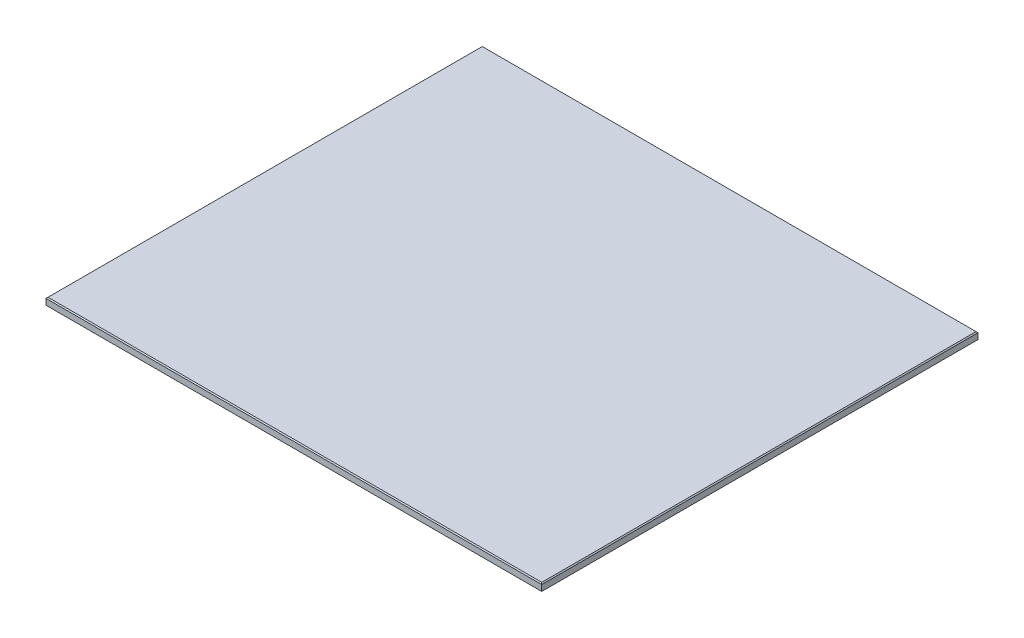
from build123d import *

# Parameters (mm, degrees)
SKETCH_1_W      = 250
SKETCH_1_H      = 220
EXTRUDE_1_DEPTH = 4
CHAMFER_1_SIZE  = 0.5


with BuildPart() as part:
    # Sketch 1 → Extrude 1 (new body)
    with BuildSketch(Plane(origin=(0, 0, 0), x_dir=(1, 0, 0), z_dir=(0, 1, 0))):
        Rectangle(SKETCH_1_W, SKETCH_1_H)
    extrude(amount=EXTRUDE_1_DEPTH)

    # Chamfer 1
    chamfer_1_edges = [part.edges().sort_by_distance(p)[0] for p in [
        (-125, 4, 0),
        (0, 4, 110),
        (125, 4, 0),
        (0, 0, 110),
        (-125, 0, 0),
        (0, 0, -110),
        (125, 0, 0),
        (0, 4, -110),
    ]]
    chamfer(chamfer_1_edges, length=CHAMFER_1_SIZE)


solid = part.part
